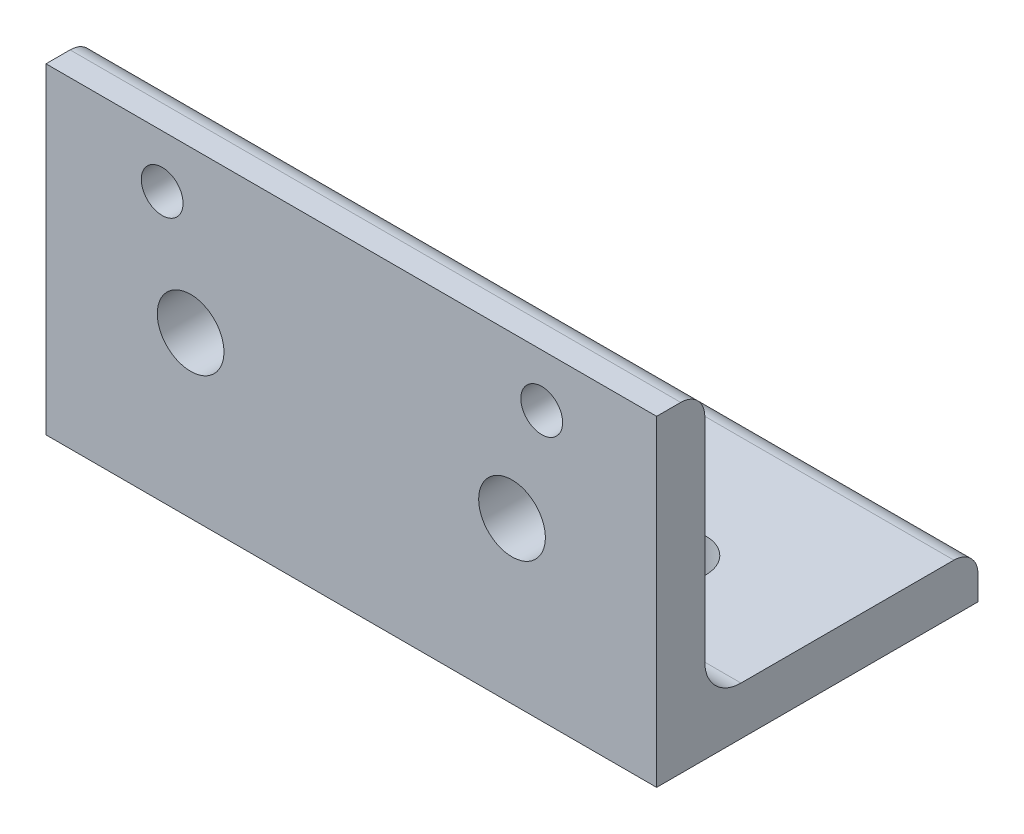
from build123d import *

# Parameters (mm, degrees)
SKETCH1_W                  = 76
SKETCH1_H                  = 40
BOSS_EXTRUDE1_DEPTH        = 40
SKETCH2_W                  = 34
SKETCH2_H                  = 34
CUT_EXTRUDE1_DEPTH         = 95.741754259
F_8_3_8_3_DIAMETER_HOLE1_D = 8.3
F_8_3_8_3_DIAMETER_HOLE2_D = 8.3
FILLET1_R                  = 4.5
FILLET2_R                  = 3
SKETCH7_R                  = 2.6
CUT_EXTRUDE2_DEPTH         = 95.741754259


with BuildPart() as part:
    # Sketch1 → Boss-Extrude1 (new body)
    with BuildSketch(Plane.XY):
        with Locations((38, 20)):
            Rectangle(SKETCH1_W, SKETCH1_H)
    extrude(amount=-BOSS_EXTRUDE1_DEPTH)

    # Sketch2 → Cut-Extrude1 (cut, through all)
    with BuildSketch(Plane(origin=(76, 0, 0), x_dir=(0, 0, -1), z_dir=(1, 0, 0))):
        with Locations((23, 23)):
            Rectangle(SKETCH2_W, SKETCH2_H)
    extrude(amount=-CUT_EXTRUDE1_DEPTH, mode=Mode.SUBTRACT)

    # 8.3 _8.3_ Diameter Hole1 (through all)
    with Locations(Plane(origin=(0, 6, 0), x_dir=(1, 0, 0), z_dir=(0, 1, 0))):
        with Locations((18, 20), (58, 20)):
            Hole(F_8_3_8_3_DIAMETER_HOLE1_D / 2)

    # 8.3 _8.3_ Diameter Hole2 (through all)
    with Locations(Plane(origin=(0, 0, -6), x_dir=(-1, 0, 0), z_dir=(0, 0, -1))):
        with Locations((-58, 20), (-18, 20)):
            Hole(F_8_3_8_3_DIAMETER_HOLE2_D / 2)

    # Fillet1
    fillet1_edges = [part.edges().sort_by_distance(p)[0] for p in [
        (38, 6, -6),
    ]]
    fillet(fillet1_edges, radius=FILLET1_R)

    # Fillet2
    fillet2_edges = [part.edges().sort_by_distance(p)[0] for p in [
        (38, 40, -6),
        (38, 6, -40),
    ]]
    fillet(fillet2_edges, radius=FILLET2_R)

    # Sketch7 → Cut-Extrude2 (cut, through all)
    with BuildSketch(Plane.XY):
        with Locations((14.45955067, 33.476)):
            Circle(SKETCH7_R)
        with Locations((61.699550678, 33.476)):
            Circle(SKETCH7_R)
    extrude(amount=-CUT_EXTRUDE2_DEPTH, mode=Mode.SUBTRACT)


solid = part.part
